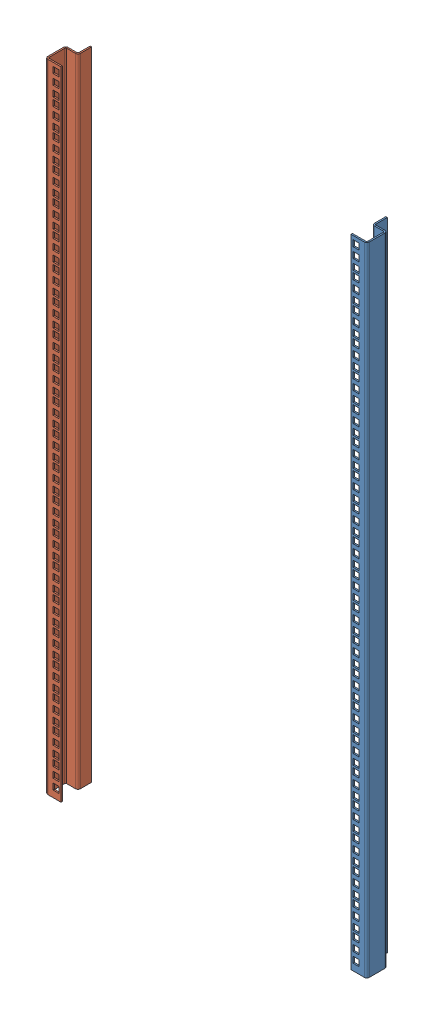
SolidWorks assembly Assem1.sldasm, configuration Default (file format 7000). Lengths in mm.
Overall size (500.13 990.6 50.8).
2 component instances, 2 part files, 3 mates.
Components (placement in the parent):
- U22-1-1: U22-1.SLDPRT [Default] at (-37.5354 -550.9396 89.4747) size (24.51 990.6 50.8)
- U22-2-1: U22-2.SLDPRT [Default] at (-537.6614 -550.9396 89.4747) size (24.51 990.6 50.8)
Mates (geometry in assembly coordinates):
- Coincident1: coincident: plane of U22-1-1 through (-39.8214 439.6604 85.6139) normal (0 1 0); plane of U22-2-1 through (-90.0467 439.6604 56.1499) normal (0 1 0)
- Coincident2: coincident: plane of U22-1-1 through (-62.0464 439.6604 89.4747) normal (0 0 1); plane of U22-2-1 through (-83.0109 439.6604 89.4747) normal (0 0 1)
- Distance1: distance = 451.104 mm anti-aligned: plane of U22-2-1 through (-513.1504 439.6604 87.1887) normal (1 0 0); plane of U22-1-1 through (-62.0464 439.6604 89.4747) normal (-1 0 0)
